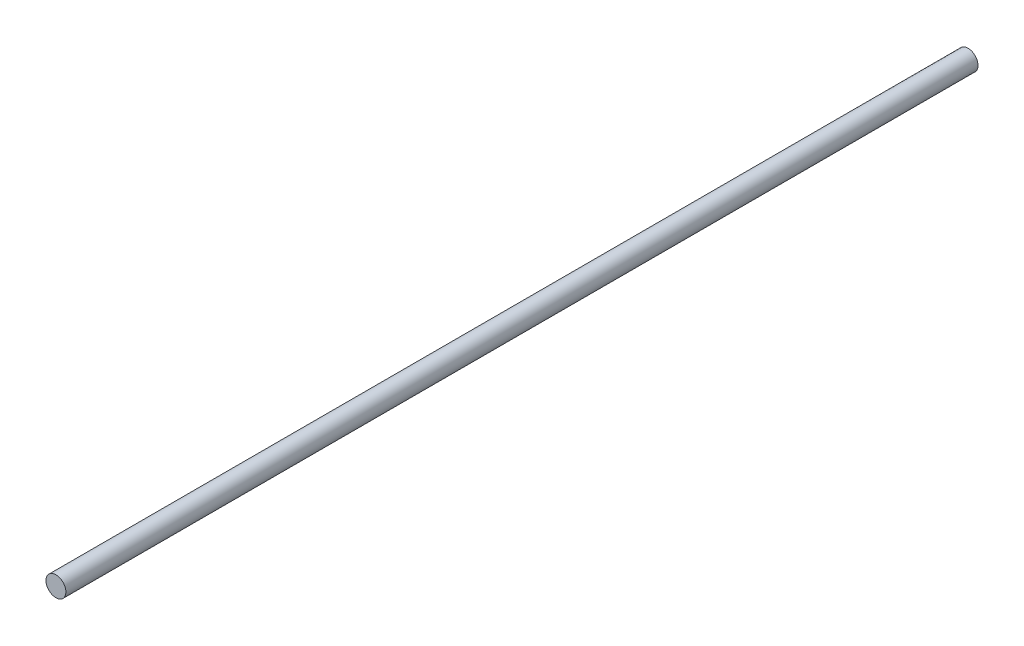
from build123d import *

# Parameters (mm, degrees)
SKETCH1_R           = 30
BOSS_EXTRUDE1_DEPTH = 2750


with BuildPart() as part:
    # Sketch1 → Boss-Extrude1 (new body)
    with BuildSketch(Plane.XY):
        Circle(SKETCH1_R)
    extrude(amount=-BOSS_EXTRUDE1_DEPTH)


solid = part.part
